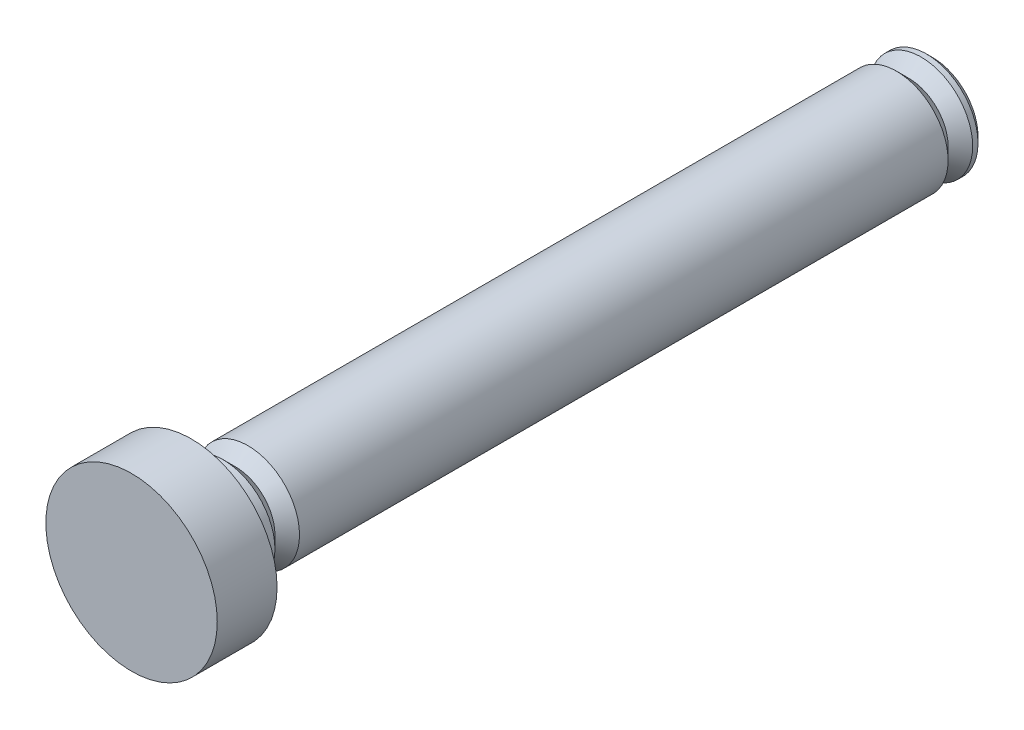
from build123d import *


with BuildPart() as part:
    # Sketch1 → Revolve1 (revolve)
    with BuildSketch(Plane(origin=(0, 0, 0), x_dir=(0, 0, -1), z_dir=(1, 0, 0)), mode=Mode.PRIVATE) as revolve1_sk:
        Polygon((0, 0), (38.1, 0), (38.1, 2.159), (37.8079, 2.4511), (37.5539, 2.4511), (36.9697, 1.8669), (36.3855, 2.4511), (5.5372, 2.4511), (4.953, 1.8669), (4.3688, 2.4511), (2.8448, 2.4511), (2.8448, 4.0767), (0, 4.0767), align=None)
    revolve(revolve1_sk.sketch.rotate(Axis((0, 0, 0), (0, 0, -1)), 90), axis=Axis((0, 0, 0), (0, 0, -1)))


solid = part.part
